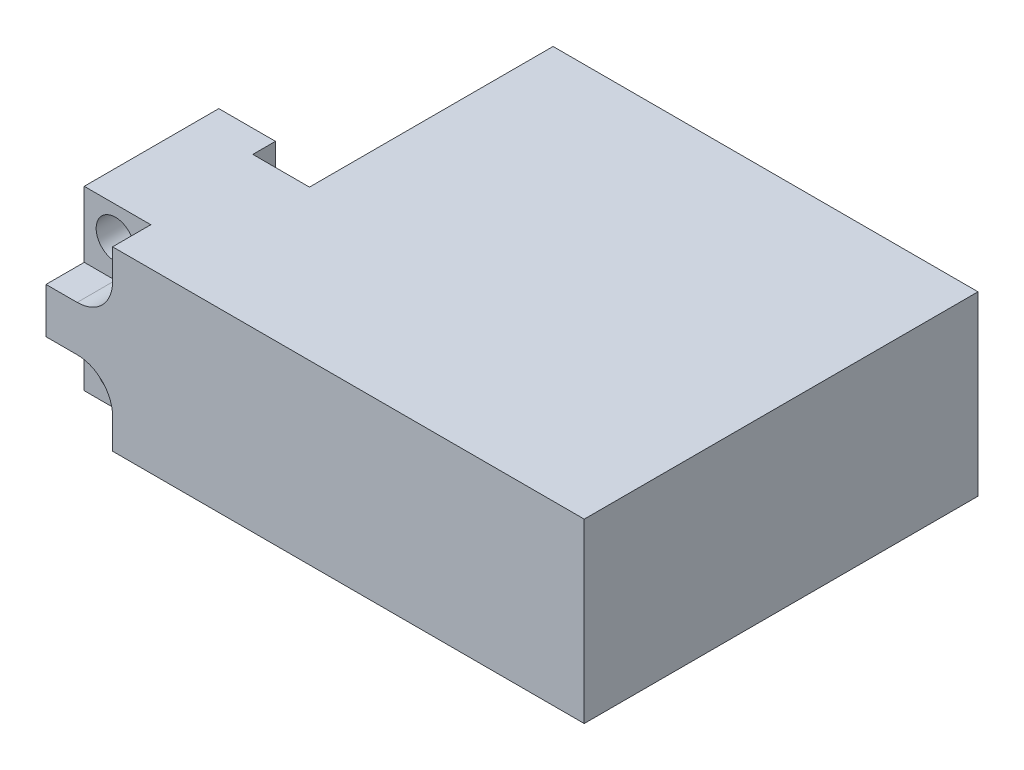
from build123d import *

# Parameters (mm, degrees)
EXTRUDE1_DEPTH                                 = 7.9375
CBORE_FOR_5_SOCKET_HEAD_CAP_SCREW1_D           = 3.4544
CBORE_FOR_5_SOCKET_HEAD_CAP_SCREW1_CBORE_D     = 6.35
CBORE_FOR_5_SOCKET_HEAD_CAP_SCREW1_CBORE_DEPTH = 3.429
CUT_EXTRUDE2_DEPTH                             = 3.429


with BuildPart() as part:
    # Sketch1 → Extrude1 (new, symmetric)
    with BuildSketch(Plane(origin=(0, 0, 0), x_dir=(1, 0, 0), z_dir=(0, 1, 0))):
        Polygon((-10.16, 15.494), (-10.16, 0), (38.1, 0), (38.1, 35.306), (0, 35.306), (0, 13.462), (-5.08, 13.462), (-5.08, 15.494), align=None)
    extrude(amount=EXTRUDE1_DEPTH, both=True)

    # CBORE for _5 Socket Head Cap Screw1 (through all)
    with Locations(Plane(origin=(-7.366, 5.207, 0), x_dir=(1, 0, 0), z_dir=(0, 0, 1))):
        with Locations((0, 0)):
            cbore_for_5_socket_head_cap_screw1 = CounterBoreHole(CBORE_FOR_5_SOCKET_HEAD_CAP_SCREW1_D / 2, CBORE_FOR_5_SOCKET_HEAD_CAP_SCREW1_CBORE_D / 2, CBORE_FOR_5_SOCKET_HEAD_CAP_SCREW1_CBORE_DEPTH)

    # Sketch4 → Cut-Extrude2 (cut)
    with BuildSketch(Plane.XY):
        with BuildLine():
            Line((-4.191, 5.207), (-4.191, 7.9375))
            Line((-4.191, 7.9375), (-10.16, 7.9375))
            Line((-10.16, 7.9375), (-10.16, 2.032))
            Line((-10.16, 2.032), (-7.366, 2.032))
            ThreePointArc((-7.366, 2.032), (-5.12093597, 2.96193597), (-4.191, 5.207))
        make_face()
    cut_extrude2 = extrude(amount=-CUT_EXTRUDE2_DEPTH, mode=Mode.SUBTRACT)

    # Mirror1: CBORE for _5 Socket Head Cap Screw1, Cut-Extrude2 across plane
    add(cbore_for_5_socket_head_cap_screw1.mirror(Plane.ZX), mode=Mode.SUBTRACT)
    add(cut_extrude2.mirror(Plane.ZX), mode=Mode.SUBTRACT)


solid = part.part
